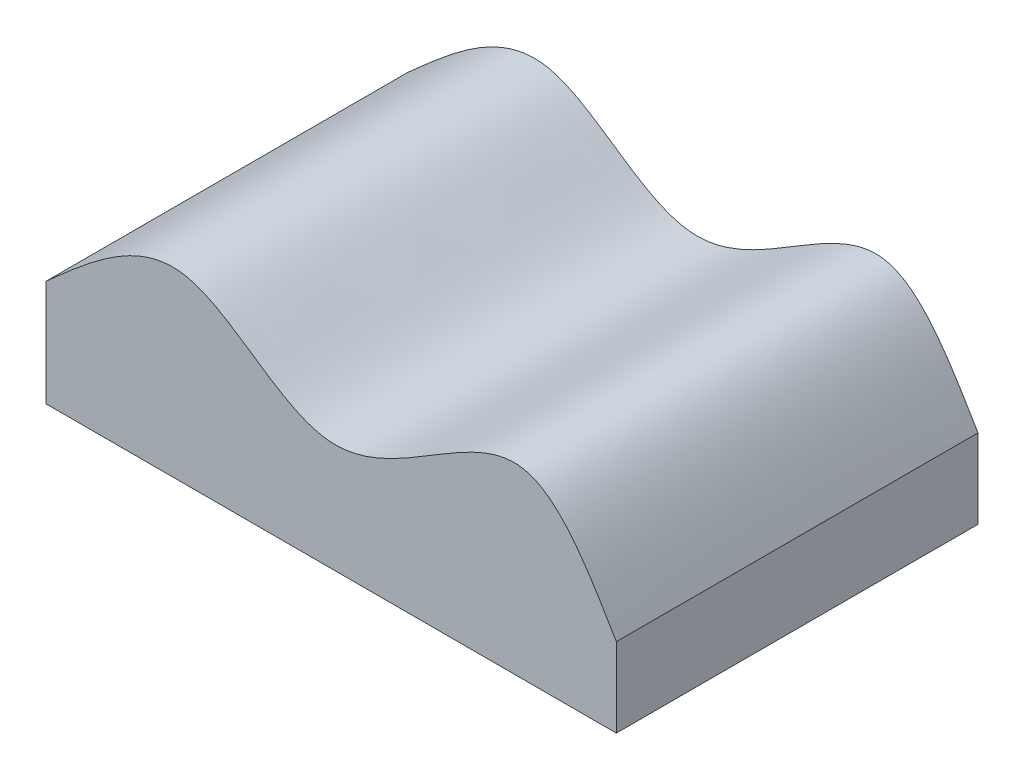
from build123d import *

# Parameters (mm, degrees)
EXTRUDE1_DEPTH = 35.5


with BuildPart() as part:
    # Sketch1 → Extrude1 (new, symmetric)
    with BuildSketch(Plane(origin=(0, 0, 0), x_dir=(-1, 0, 0), z_dir=(0, 0, 1))):
        with BuildLine():
            Line((-55.98615917, 0), (55.98615917, 0))
            Line((55.98615917, 0), (55.98615917, -20.83929258))
            add(Edge.make_bspline(
                [(-55.98615917, -15.55171088), (-50.304253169, -25.210797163), (-36.390991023, -48.862965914), (-1.405548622, -7.267067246), (28.475289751, -45.425563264), (46.950839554, -28.91409423), (55.98615917, -20.83929258)],
                knots=[0, 0, 0, 0, 0.211458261, 0.517797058, 0.764182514, 1, 1, 1, 1], degree=3))
            Line((-55.98615917, -15.55171088), (-55.98615917, 0))
        make_face()
    extrude(amount=EXTRUDE1_DEPTH, both=True)


solid = part.part
